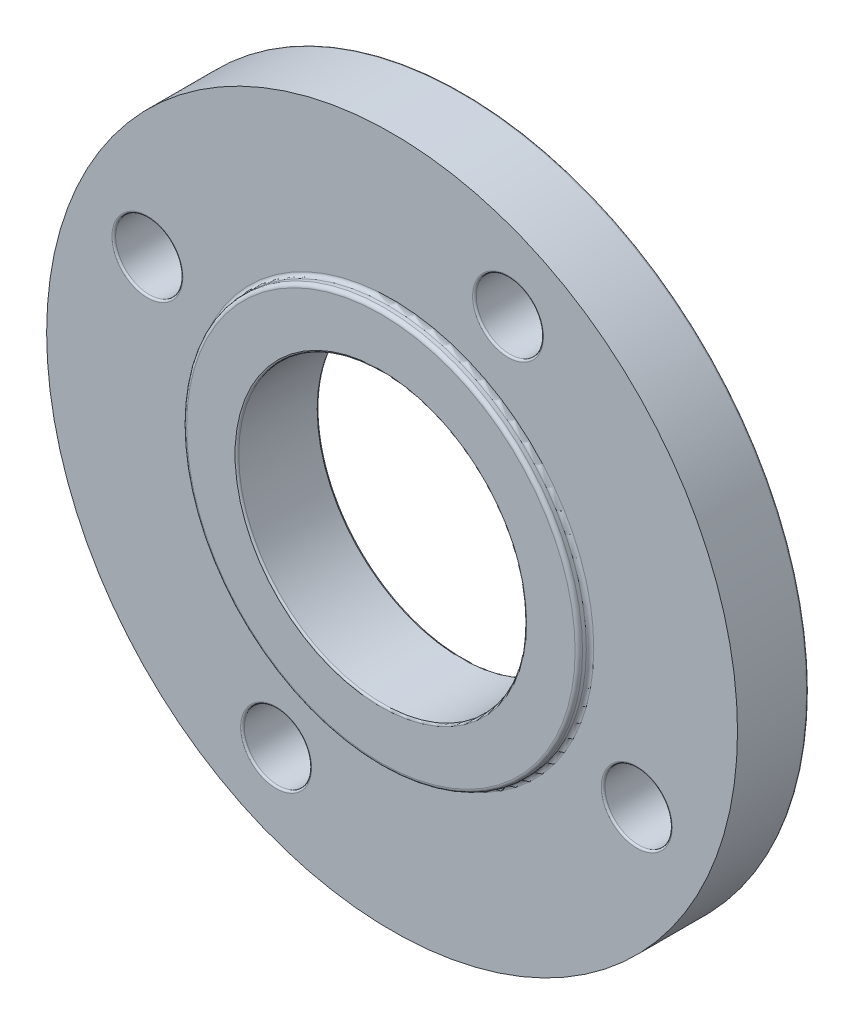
ISO-10303-21;
HEADER;
FILE_DESCRIPTION(('STEP AP214'),'2;1');
FILE_NAME('part.step','',(''),(''),'','','');
FILE_SCHEMA(('AUTOMOTIVE_DESIGN { 1 0 10303 214 1 1 1 1 }'));
ENDSEC;
DATA;
#1=APPLICATION_CONTEXT('core data for automotive mechanical design processes');
#2=APPLICATION_PROTOCOL_DEFINITION('international standard','automotive_design',2000,#1);
#3=PRODUCT_CONTEXT('',#1,'mechanical');
#4=PRODUCT('Part','Part','',(#3));
#5=PRODUCT_RELATED_PRODUCT_CATEGORY('part','',(#4));
#6=PRODUCT_DEFINITION_FORMATION('','',#4);
#7=PRODUCT_DEFINITION_CONTEXT('part definition',#1,'design');
#8=PRODUCT_DEFINITION('design','',#6,#7);
#9=PRODUCT_DEFINITION_SHAPE('','',#8);
#10=(LENGTH_UNIT() NAMED_UNIT(*) SI_UNIT(.MILLI.,.METRE.));
#11=(NAMED_UNIT(*) PLANE_ANGLE_UNIT() SI_UNIT($,.RADIAN.));
#12=(NAMED_UNIT(*) SI_UNIT($,.STERADIAN.) SOLID_ANGLE_UNIT());
#13=UNCERTAINTY_MEASURE_WITH_UNIT(LENGTH_MEASURE(1.E-05),#10,'distance_accuracy_value','');
#14=(GEOMETRIC_REPRESENTATION_CONTEXT(3) GLOBAL_UNCERTAINTY_ASSIGNED_CONTEXT((#13)) GLOBAL_UNIT_ASSIGNED_CONTEXT((#10,
#11,#12)) REPRESENTATION_CONTEXT('',''));
#15=CARTESIAN_POINT('',(0.,0.,0.));
#16=DIRECTION('',(0.,0.,1.));
#17=DIRECTION('',(1.,0.,0.));
#18=AXIS2_PLACEMENT_3D('',#15,#16,#17);
#19=CARTESIAN_POINT('',(0.,0.,22.));
#20=DIRECTION('',(0.,0.,1.));
#21=DIRECTION('',(1.,0.,0.));
#22=AXIS2_PLACEMENT_3D('',#19,#20,#21);
#23=PLANE('',#22);
#24=CARTESIAN_POINT('',(0.,0.,22.));
#25=DIRECTION('',(0.,0.,1.));
#26=DIRECTION('',(1.,0.,0.));
#27=AXIS2_PLACEMENT_3D('',#24,#25,#26);
#28=CIRCLE('',#27,52.0122693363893);
#29=CARTESIAN_POINT('',(52.0122693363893,0.,22.));
#30=VERTEX_POINT('',#29);
#31=EDGE_CURVE('E86',#30,#30,#28,.T.);
#32=ORIENTED_EDGE('',*,*,#31,.T.);
#33=EDGE_LOOP('',(#32));
#34=FACE_BOUND('',#33,.T.);
#35=CARTESIAN_POINT('',(0.,0.,22.));
#36=DIRECTION('',(0.,0.,1.));
#37=DIRECTION('',(1.,0.,0.));
#38=AXIS2_PLACEMENT_3D('',#35,#36,#37);
#39=CIRCLE('',#38,39.05);
#40=CARTESIAN_POINT('',(39.05,0.,22.));
#41=VERTEX_POINT('',#40);
#42=EDGE_CURVE('E105',#41,#41,#39,.F.);
#43=ORIENTED_EDGE('',*,*,#42,.T.);
#44=EDGE_LOOP('',(#43));
#45=FACE_BOUND('',#44,.T.);
#46=ADVANCED_FACE('F30',(#34,#45),#23,.T.);
#47=CARTESIAN_POINT('',(0.,0.,22.));
#48=DIRECTION('',(0.,0.,-1.));
#49=DIRECTION('',(-1.,0.,0.));
#50=AXIS2_PLACEMENT_3D('',#47,#48,#49);
#51=CYLINDRICAL_SURFACE('',#50,92.5);
#52=CARTESIAN_POINT('',(0.,0.,0.5));
#53=DIRECTION('',(0.,0.,1.));
#54=DIRECTION('',(1.,0.,0.));
#55=AXIS2_PLACEMENT_3D('',#52,#53,#54);
#56=CIRCLE('',#55,92.5);
#57=CARTESIAN_POINT('',(92.5,0.,0.5));
#58=VERTEX_POINT('',#57);
#59=EDGE_CURVE('E98',#58,#58,#56,.T.);
#60=ORIENTED_EDGE('',*,*,#59,.T.);
#61=EDGE_LOOP('',(#60));
#62=FACE_BOUND('',#61,.T.);
#63=CARTESIAN_POINT('',(0.,0.,19.));
#64=DIRECTION('',(0.,0.,1.));
#65=DIRECTION('',(1.,0.,0.));
#66=AXIS2_PLACEMENT_3D('',#63,#64,#65);
#67=CIRCLE('',#66,92.5);
#68=CARTESIAN_POINT('',(92.5,0.,19.));
#69=VERTEX_POINT('',#68);
#70=EDGE_CURVE('E99',#69,#69,#67,.T.);
#71=ORIENTED_EDGE('',*,*,#70,.F.);
#72=EDGE_LOOP('',(#71));
#73=FACE_BOUND('',#72,.T.);
#74=ADVANCED_FACE('F130',(#62,#73),#51,.T.);
#75=CARTESIAN_POINT('',(0.,0.,0.));
#76=DIRECTION('',(0.,0.,1.));
#77=DIRECTION('',(1.,0.,0.));
#78=AXIS2_PLACEMENT_3D('',#75,#76,#77);
#79=PLANE('',#78);
#80=CARTESIAN_POINT('',(-31.0521182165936,-65.513479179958,0.));
#81=DIRECTION('',(0.,0.,1.));
#82=DIRECTION('',(1.,0.,0.));
#83=AXIS2_PLACEMENT_3D('',#80,#81,#82);
#84=CIRCLE('',#83,9.50000000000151);
#85=CARTESIAN_POINT('',(-21.5521182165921,-65.513479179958,0.));
#86=VERTEX_POINT('',#85);
#87=EDGE_CURVE('E56',#86,#86,#84,.T.);
#88=ORIENTED_EDGE('',*,*,#87,.T.);
#89=EDGE_LOOP('',(#88));
#90=FACE_BOUND('',#89,.T.);
#91=CARTESIAN_POINT('',(65.5134791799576,-31.0521182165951,0.));
#92=DIRECTION('',(0.,0.,1.));
#93=DIRECTION('',(1.,0.,0.));
#94=AXIS2_PLACEMENT_3D('',#91,#92,#93);
#95=CIRCLE('',#94,9.50000000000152);
#96=CARTESIAN_POINT('',(75.0134791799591,-31.0521182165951,0.));
#97=VERTEX_POINT('',#96);
#98=EDGE_CURVE('E59',#97,#97,#95,.T.);
#99=ORIENTED_EDGE('',*,*,#98,.T.);
#100=EDGE_LOOP('',(#99));
#101=FACE_BOUND('',#100,.T.);
#102=CARTESIAN_POINT('',(31.0521182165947,65.513479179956,0.));
#103=DIRECTION('',(0.,0.,1.));
#104=DIRECTION('',(1.,0.,0.));
#105=AXIS2_PLACEMENT_3D('',#102,#103,#104);
#106=CIRCLE('',#105,9.50000000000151);
#107=CARTESIAN_POINT('',(40.5521182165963,65.513479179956,0.));
#108=VERTEX_POINT('',#107);
#109=EDGE_CURVE('E62',#108,#108,#106,.T.);
#110=ORIENTED_EDGE('',*,*,#109,.T.);
#111=EDGE_LOOP('',(#110));
#112=FACE_BOUND('',#111,.T.);
#113=CARTESIAN_POINT('',(-65.5134791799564,31.0521182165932,0.));
#114=DIRECTION('',(0.,0.,1.));
#115=DIRECTION('',(1.,0.,0.));
#116=AXIS2_PLACEMENT_3D('',#113,#114,#115);
#117=CIRCLE('',#116,9.50000000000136);
#118=CARTESIAN_POINT('',(-56.0134791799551,31.0521182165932,0.));
#119=VERTEX_POINT('',#118);
#120=EDGE_CURVE('E65',#119,#119,#117,.T.);
#121=ORIENTED_EDGE('',*,*,#120,.T.);
#122=EDGE_LOOP('',(#121));
#123=FACE_BOUND('',#122,.T.);
#124=CARTESIAN_POINT('',(0.,0.,0.));
#125=DIRECTION('',(0.,0.,1.));
#126=DIRECTION('',(1.,0.,0.));
#127=AXIS2_PLACEMENT_3D('',#124,#125,#126);
#128=CIRCLE('',#127,39.05);
#129=CARTESIAN_POINT('',(39.05,0.,0.));
#130=VERTEX_POINT('',#129);
#131=EDGE_CURVE('E114',#130,#130,#128,.T.);
#132=ORIENTED_EDGE('',*,*,#131,.T.);
#133=EDGE_LOOP('',(#132));
#134=FACE_BOUND('',#133,.T.);
#135=CARTESIAN_POINT('',(0.,0.,0.));
#136=DIRECTION('',(0.,0.,1.));
#137=DIRECTION('',(1.,0.,0.));
#138=AXIS2_PLACEMENT_3D('',#135,#136,#137);
#139=CIRCLE('',#138,92.);
#140=CARTESIAN_POINT('',(92.,0.,0.));
#141=VERTEX_POINT('',#140);
#142=EDGE_CURVE('E102',#141,#141,#139,.F.);
#143=ORIENTED_EDGE('',*,*,#142,.T.);
#144=EDGE_LOOP('',(#143));
#145=FACE_BOUND('',#144,.T.);
#146=ADVANCED_FACE('F120',(#90,#101,#112,#123,#134,#145),#79,.F.);
#147=CARTESIAN_POINT('',(0.,0.,22.));
#148=DIRECTION('',(0.,0.,-1.));
#149=DIRECTION('',(-1.,0.,0.));
#150=AXIS2_PLACEMENT_3D('',#147,#148,#149);
#151=CYLINDRICAL_SURFACE('',#150,38.55);
#152=CARTESIAN_POINT('',(0.,0.,0.5));
#153=DIRECTION('',(0.,0.,1.));
#154=DIRECTION('',(1.,0.,0.));
#155=AXIS2_PLACEMENT_3D('',#152,#153,#154);
#156=CIRCLE('',#155,38.55);
#157=CARTESIAN_POINT('',(38.55,0.,0.5));
#158=VERTEX_POINT('',#157);
#159=EDGE_CURVE('E108',#158,#158,#156,.F.);
#160=ORIENTED_EDGE('',*,*,#159,.T.);
#161=EDGE_LOOP('',(#160));
#162=FACE_BOUND('',#161,.T.);
#163=CARTESIAN_POINT('',(0.,0.,21.5));
#164=DIRECTION('',(0.,0.,1.));
#165=DIRECTION('',(1.,0.,0.));
#166=AXIS2_PLACEMENT_3D('',#163,#164,#165);
#167=CIRCLE('',#166,38.55);
#168=CARTESIAN_POINT('',(38.55,0.,21.5));
#169=VERTEX_POINT('',#168);
#170=EDGE_CURVE('E111',#169,#169,#167,.T.);
#171=ORIENTED_EDGE('',*,*,#170,.T.);
#172=EDGE_LOOP('',(#171));
#173=FACE_BOUND('',#172,.T.);
#174=ADVANCED_FACE('F155',(#162,#173),#151,.F.);
#175=CARTESIAN_POINT('',(0.,0.,0.5));
#176=DIRECTION('',(0.,0.,1.));
#177=DIRECTION('',(1.,0.,0.));
#178=AXIS2_PLACEMENT_3D('',#175,#176,#177);
#179=TOROIDAL_SURFACE('',#178,39.05,0.5);
#180=ORIENTED_EDGE('',*,*,#159,.F.);
#181=EDGE_LOOP('',(#180));
#182=FACE_BOUND('',#181,.T.);
#183=ORIENTED_EDGE('',*,*,#131,.F.);
#184=EDGE_LOOP('',(#183));
#185=FACE_BOUND('',#184,.T.);
#186=ADVANCED_FACE('F159',(#182,#185),#179,.T.);
#187=CARTESIAN_POINT('',(0.,0.,21.5));
#188=DIRECTION('',(0.,0.,1.));
#189=DIRECTION('',(1.,0.,0.));
#190=AXIS2_PLACEMENT_3D('',#187,#188,#189);
#191=TOROIDAL_SURFACE('',#190,39.05,0.5);
#192=ORIENTED_EDGE('',*,*,#42,.F.);
#193=EDGE_LOOP('',(#192));
#194=FACE_BOUND('',#193,.T.);
#195=ORIENTED_EDGE('',*,*,#170,.F.);
#196=EDGE_LOOP('',(#195));
#197=FACE_BOUND('',#196,.T.);
#198=ADVANCED_FACE('F126',(#194,#197),#191,.T.);
#199=CARTESIAN_POINT('',(0.,0.,0.5));
#200=DIRECTION('',(0.,0.,1.));
#201=DIRECTION('',(1.,0.,0.));
#202=AXIS2_PLACEMENT_3D('',#199,#200,#201);
#203=TOROIDAL_SURFACE('',#202,92.,0.5);
#204=ORIENTED_EDGE('',*,*,#142,.F.);
#205=EDGE_LOOP('',(#204));
#206=FACE_BOUND('',#205,.T.);
#207=ORIENTED_EDGE('',*,*,#59,.F.);
#208=EDGE_LOOP('',(#207));
#209=FACE_BOUND('',#208,.T.);
#210=ADVANCED_FACE('F122',(#206,#209),#203,.T.);
#211=CARTESIAN_POINT('',(0.,0.,19.));
#212=DIRECTION('',(0.,0.,1.));
#213=DIRECTION('',(1.,0.,0.));
#214=AXIS2_PLACEMENT_3D('',#211,#212,#213);
#215=PLANE('',#214);
#216=CARTESIAN_POINT('',(-31.0521182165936,-65.513479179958,19.));
#217=DIRECTION('',(0.,0.,1.));
#218=DIRECTION('',(1.,0.,0.));
#219=AXIS2_PLACEMENT_3D('',#216,#217,#218);
#220=CIRCLE('',#219,9.50000000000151);
#221=CARTESIAN_POINT('',(-21.5521182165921,-65.513479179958,19.));
#222=VERTEX_POINT('',#221);
#223=EDGE_CURVE('E68',#222,#222,#220,.F.);
#224=ORIENTED_EDGE('',*,*,#223,.T.);
#225=EDGE_LOOP('',(#224));
#226=FACE_BOUND('',#225,.T.);
#227=CARTESIAN_POINT('',(65.5134791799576,-31.0521182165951,19.));
#228=DIRECTION('',(0.,0.,1.));
#229=DIRECTION('',(1.,0.,0.));
#230=AXIS2_PLACEMENT_3D('',#227,#228,#229);
#231=CIRCLE('',#230,9.50000000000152);
#232=CARTESIAN_POINT('',(75.0134791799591,-31.0521182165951,19.));
#233=VERTEX_POINT('',#232);
#234=EDGE_CURVE('E71',#233,#233,#231,.F.);
#235=ORIENTED_EDGE('',*,*,#234,.T.);
#236=EDGE_LOOP('',(#235));
#237=FACE_BOUND('',#236,.T.);
#238=CARTESIAN_POINT('',(31.0521182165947,65.513479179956,19.));
#239=DIRECTION('',(0.,0.,1.));
#240=DIRECTION('',(1.,0.,0.));
#241=AXIS2_PLACEMENT_3D('',#238,#239,#240);
#242=CIRCLE('',#241,9.50000000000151);
#243=CARTESIAN_POINT('',(40.5521182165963,65.513479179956,19.));
#244=VERTEX_POINT('',#243);
#245=EDGE_CURVE('E74',#244,#244,#242,.F.);
#246=ORIENTED_EDGE('',*,*,#245,.T.);
#247=EDGE_LOOP('',(#246));
#248=FACE_BOUND('',#247,.T.);
#249=CARTESIAN_POINT('',(-65.5134791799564,31.0521182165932,19.));
#250=DIRECTION('',(0.,0.,1.));
#251=DIRECTION('',(1.,0.,0.));
#252=AXIS2_PLACEMENT_3D('',#249,#250,#251);
#253=CIRCLE('',#252,9.50000000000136);
#254=CARTESIAN_POINT('',(-56.0134791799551,31.0521182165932,19.));
#255=VERTEX_POINT('',#254);
#256=EDGE_CURVE('E77',#255,#255,#253,.F.);
#257=ORIENTED_EDGE('',*,*,#256,.T.);
#258=EDGE_LOOP('',(#257));
#259=FACE_BOUND('',#258,.T.);
#260=CARTESIAN_POINT('',(0.,0.,19.));
#261=DIRECTION('',(0.,0.,1.));
#262=DIRECTION('',(1.,0.,0.));
#263=AXIS2_PLACEMENT_3D('',#260,#261,#262);
#264=CIRCLE('',#263,54.0122693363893);
#265=CARTESIAN_POINT('',(54.0122693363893,0.,19.));
#266=VERTEX_POINT('',#265);
#267=EDGE_CURVE('E89',#266,#266,#264,.F.);
#268=ORIENTED_EDGE('',*,*,#267,.T.);
#269=EDGE_LOOP('',(#268));
#270=FACE_BOUND('',#269,.T.);
#271=ORIENTED_EDGE('',*,*,#70,.T.);
#272=EDGE_LOOP('',(#271));
#273=FACE_BOUND('',#272,.T.);
#274=ADVANCED_FACE('F125',(#226,#237,#248,#259,#270,#273),#215,.T.);
#275=CARTESIAN_POINT('',(0.,0.,19.));
#276=DIRECTION('',(0.,0.,1.));
#277=DIRECTION('',(1.,0.,0.));
#278=AXIS2_PLACEMENT_3D('',#275,#276,#277);
#279=CYLINDRICAL_SURFACE('',#278,53.0122693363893);
#280=CARTESIAN_POINT('',(0.,0.,20.));
#281=DIRECTION('',(0.,0.,1.));
#282=DIRECTION('',(1.,0.,0.));
#283=AXIS2_PLACEMENT_3D('',#280,#281,#282);
#284=CIRCLE('',#283,53.0122693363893);
#285=CARTESIAN_POINT('',(53.0122693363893,0.,20.));
#286=VERTEX_POINT('',#285);
#287=EDGE_CURVE('E92',#286,#286,#284,.T.);
#288=ORIENTED_EDGE('',*,*,#287,.T.);
#289=EDGE_LOOP('',(#288));
#290=FACE_BOUND('',#289,.T.);
#291=CARTESIAN_POINT('',(0.,0.,21.));
#292=DIRECTION('',(0.,0.,1.));
#293=DIRECTION('',(1.,0.,0.));
#294=AXIS2_PLACEMENT_3D('',#291,#292,#293);
#295=CIRCLE('',#294,53.0122693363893);
#296=CARTESIAN_POINT('',(53.0122693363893,0.,21.));
#297=VERTEX_POINT('',#296);
#298=EDGE_CURVE('E95',#297,#297,#295,.F.);
#299=ORIENTED_EDGE('',*,*,#298,.T.);
#300=EDGE_LOOP('',(#299));
#301=FACE_BOUND('',#300,.T.);
#302=ADVANCED_FACE('F137',(#290,#301),#279,.T.);
#303=CARTESIAN_POINT('',(0.,0.,20.));
#304=DIRECTION('',(0.,0.,1.));
#305=DIRECTION('',(1.,0.,0.));
#306=AXIS2_PLACEMENT_3D('',#303,#304,#305);
#307=TOROIDAL_SURFACE('',#306,54.0122693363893,1.);
#308=ORIENTED_EDGE('',*,*,#267,.F.);
#309=EDGE_LOOP('',(#308));
#310=FACE_BOUND('',#309,.T.);
#311=ORIENTED_EDGE('',*,*,#287,.F.);
#312=EDGE_LOOP('',(#311));
#313=FACE_BOUND('',#312,.T.);
#314=ADVANCED_FACE('F143',(#310,#313),#307,.F.);
#315=CARTESIAN_POINT('',(0.,0.,21.));
#316=DIRECTION('',(0.,0.,1.));
#317=DIRECTION('',(1.,0.,0.));
#318=AXIS2_PLACEMENT_3D('',#315,#316,#317);
#319=TOROIDAL_SURFACE('',#318,52.0122693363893,1.);
#320=ORIENTED_EDGE('',*,*,#298,.F.);
#321=EDGE_LOOP('',(#320));
#322=FACE_BOUND('',#321,.T.);
#323=ORIENTED_EDGE('',*,*,#31,.F.);
#324=EDGE_LOOP('',(#323));
#325=FACE_BOUND('',#324,.T.);
#326=ADVANCED_FACE('F168',(#322,#325),#319,.T.);
#327=CARTESIAN_POINT('',(65.5134791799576,-31.0521182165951,0.));
#328=DIRECTION('',(0.,0.,1.));
#329=DIRECTION('',(1.,0.,0.));
#330=AXIS2_PLACEMENT_3D('',#327,#328,#329);
#331=CYLINDRICAL_SURFACE('',#330,9.00000000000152);
#332=CARTESIAN_POINT('',(65.5134791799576,-31.0521182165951,18.5));
#333=DIRECTION('',(0.,0.,1.));
#334=DIRECTION('',(1.,0.,0.));
#335=AXIS2_PLACEMENT_3D('',#332,#333,#334);
#336=CIRCLE('',#335,9.00000000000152);
#337=CARTESIAN_POINT('',(74.5134791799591,-31.0521182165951,18.5));
#338=VERTEX_POINT('',#337);
#339=EDGE_CURVE('E50',#338,#338,#336,.T.);
#340=ORIENTED_EDGE('',*,*,#339,.T.);
#341=EDGE_LOOP('',(#340));
#342=FACE_BOUND('',#341,.T.);
#343=CARTESIAN_POINT('',(65.5134791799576,-31.0521182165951,0.5));
#344=DIRECTION('',(0.,0.,1.));
#345=DIRECTION('',(1.,0.,0.));
#346=AXIS2_PLACEMENT_3D('',#343,#344,#345);
#347=CIRCLE('',#346,9.00000000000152);
#348=CARTESIAN_POINT('',(74.5134791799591,-31.0521182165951,0.5));
#349=VERTEX_POINT('',#348);
#350=EDGE_CURVE('E53',#349,#349,#347,.F.);
#351=ORIENTED_EDGE('',*,*,#350,.T.);
#352=EDGE_LOOP('',(#351));
#353=FACE_BOUND('',#352,.T.);
#354=ADVANCED_FACE('F172',(#342,#353),#331,.F.);
#355=CARTESIAN_POINT('',(-31.0521182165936,-65.513479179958,0.));
#356=DIRECTION('',(0.,0.,1.));
#357=DIRECTION('',(1.,0.,0.));
#358=AXIS2_PLACEMENT_3D('',#355,#356,#357);
#359=CYLINDRICAL_SURFACE('',#358,9.00000000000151);
#360=CARTESIAN_POINT('',(-31.0521182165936,-65.513479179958,18.5));
#361=DIRECTION('',(0.,0.,1.));
#362=DIRECTION('',(1.,0.,0.));
#363=AXIS2_PLACEMENT_3D('',#360,#361,#362);
#364=CIRCLE('',#363,9.00000000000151);
#365=CARTESIAN_POINT('',(-22.0521182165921,-65.513479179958,18.5));
#366=VERTEX_POINT('',#365);
#367=EDGE_CURVE('E80',#366,#366,#364,.T.);
#368=ORIENTED_EDGE('',*,*,#367,.T.);
#369=EDGE_LOOP('',(#368));
#370=FACE_BOUND('',#369,.T.);
#371=CARTESIAN_POINT('',(-31.0521182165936,-65.513479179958,0.5));
#372=DIRECTION('',(0.,0.,1.));
#373=DIRECTION('',(1.,0.,0.));
#374=AXIS2_PLACEMENT_3D('',#371,#372,#373);
#375=CIRCLE('',#374,9.00000000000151);
#376=CARTESIAN_POINT('',(-22.0521182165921,-65.513479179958,0.5));
#377=VERTEX_POINT('',#376);
#378=EDGE_CURVE('E83',#377,#377,#375,.F.);
#379=ORIENTED_EDGE('',*,*,#378,.T.);
#380=EDGE_LOOP('',(#379));
#381=FACE_BOUND('',#380,.T.);
#382=ADVANCED_FACE('F283',(#370,#381),#359,.F.);
#383=CARTESIAN_POINT('',(-65.5134791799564,31.0521182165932,0.));
#384=DIRECTION('',(0.,0.,1.));
#385=DIRECTION('',(1.,0.,0.));
#386=AXIS2_PLACEMENT_3D('',#383,#384,#385);
#387=CYLINDRICAL_SURFACE('',#386,9.00000000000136);
#388=CARTESIAN_POINT('',(-65.5134791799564,31.0521182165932,0.5));
#389=DIRECTION('',(0.,0.,1.));
#390=DIRECTION('',(1.,0.,0.));
#391=AXIS2_PLACEMENT_3D('',#388,#389,#390);
#392=CIRCLE('',#391,9.00000000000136);
#393=CARTESIAN_POINT('',(-56.5134791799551,31.0521182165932,0.5));
#394=VERTEX_POINT('',#393);
#395=EDGE_CURVE('E10',#394,#394,#392,.F.);
#396=ORIENTED_EDGE('',*,*,#395,.T.);
#397=EDGE_LOOP('',(#396));
#398=FACE_BOUND('',#397,.T.);
#399=CARTESIAN_POINT('',(-65.5134791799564,31.0521182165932,18.5));
#400=DIRECTION('',(0.,0.,1.));
#401=DIRECTION('',(1.,0.,0.));
#402=AXIS2_PLACEMENT_3D('',#399,#400,#401);
#403=CIRCLE('',#402,9.00000000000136);
#404=CARTESIAN_POINT('',(-56.5134791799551,31.0521182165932,18.5));
#405=VERTEX_POINT('',#404);
#406=EDGE_CURVE('E37',#405,#405,#403,.T.);
#407=ORIENTED_EDGE('',*,*,#406,.T.);
#408=EDGE_LOOP('',(#407));
#409=FACE_BOUND('',#408,.T.);
#410=ADVANCED_FACE('F273',(#398,#409),#387,.F.);
#411=CARTESIAN_POINT('',(31.0521182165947,65.513479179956,0.));
#412=DIRECTION('',(0.,0.,1.));
#413=DIRECTION('',(1.,0.,0.));
#414=AXIS2_PLACEMENT_3D('',#411,#412,#413);
#415=CYLINDRICAL_SURFACE('',#414,9.00000000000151);
#416=CARTESIAN_POINT('',(31.0521182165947,65.513479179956,0.5));
#417=DIRECTION('',(0.,0.,1.));
#418=DIRECTION('',(1.,0.,0.));
#419=AXIS2_PLACEMENT_3D('',#416,#417,#418);
#420=CIRCLE('',#419,9.00000000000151);
#421=CARTESIAN_POINT('',(40.0521182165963,65.513479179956,0.5));
#422=VERTEX_POINT('',#421);
#423=EDGE_CURVE('E41',#422,#422,#420,.F.);
#424=ORIENTED_EDGE('',*,*,#423,.T.);
#425=EDGE_LOOP('',(#424));
#426=FACE_BOUND('',#425,.T.);
#427=CARTESIAN_POINT('',(31.0521182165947,65.513479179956,18.5));
#428=DIRECTION('',(0.,0.,1.));
#429=DIRECTION('',(1.,0.,0.));
#430=AXIS2_PLACEMENT_3D('',#427,#428,#429);
#431=CIRCLE('',#430,9.00000000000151);
#432=CARTESIAN_POINT('',(40.0521182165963,65.513479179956,18.5));
#433=VERTEX_POINT('',#432);
#434=EDGE_CURVE('E45',#433,#433,#431,.T.);
#435=ORIENTED_EDGE('',*,*,#434,.T.);
#436=EDGE_LOOP('',(#435));
#437=FACE_BOUND('',#436,.T.);
#438=ADVANCED_FACE('F178',(#426,#437),#415,.F.);
#439=CARTESIAN_POINT('',(-31.0521182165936,-65.513479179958,18.5));
#440=DIRECTION('',(0.,0.,1.));
#441=DIRECTION('',(1.,0.,0.));
#442=AXIS2_PLACEMENT_3D('',#439,#440,#441);
#443=TOROIDAL_SURFACE('',#442,9.50000000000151,0.5);
#444=ORIENTED_EDGE('',*,*,#223,.F.);
#445=EDGE_LOOP('',(#444));
#446=FACE_BOUND('',#445,.T.);
#447=ORIENTED_EDGE('',*,*,#367,.F.);
#448=EDGE_LOOP('',(#447));
#449=FACE_BOUND('',#448,.T.);
#450=ADVANCED_FACE('F174',(#446,#449),#443,.T.);
#451=CARTESIAN_POINT('',(-31.0521182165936,-65.513479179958,0.5));
#452=DIRECTION('',(0.,0.,1.));
#453=DIRECTION('',(1.,0.,0.));
#454=AXIS2_PLACEMENT_3D('',#451,#452,#453);
#455=TOROIDAL_SURFACE('',#454,9.50000000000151,0.5);
#456=ORIENTED_EDGE('',*,*,#378,.F.);
#457=EDGE_LOOP('',(#456));
#458=FACE_BOUND('',#457,.T.);
#459=ORIENTED_EDGE('',*,*,#87,.F.);
#460=EDGE_LOOP('',(#459));
#461=FACE_BOUND('',#460,.T.);
#462=ADVANCED_FACE('F177',(#458,#461),#455,.T.);
#463=CARTESIAN_POINT('',(65.5134791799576,-31.0521182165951,18.5));
#464=DIRECTION('',(0.,0.,1.));
#465=DIRECTION('',(1.,0.,0.));
#466=AXIS2_PLACEMENT_3D('',#463,#464,#465);
#467=TOROIDAL_SURFACE('',#466,9.50000000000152,0.5);
#468=ORIENTED_EDGE('',*,*,#234,.F.);
#469=EDGE_LOOP('',(#468));
#470=FACE_BOUND('',#469,.T.);
#471=ORIENTED_EDGE('',*,*,#339,.F.);
#472=EDGE_LOOP('',(#471));
#473=FACE_BOUND('',#472,.T.);
#474=ADVANCED_FACE('F182',(#470,#473),#467,.T.);
#475=CARTESIAN_POINT('',(65.5134791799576,-31.0521182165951,0.5));
#476=DIRECTION('',(0.,0.,1.));
#477=DIRECTION('',(1.,0.,0.));
#478=AXIS2_PLACEMENT_3D('',#475,#476,#477);
#479=TOROIDAL_SURFACE('',#478,9.50000000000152,0.5);
#480=ORIENTED_EDGE('',*,*,#350,.F.);
#481=EDGE_LOOP('',(#480));
#482=FACE_BOUND('',#481,.T.);
#483=ORIENTED_EDGE('',*,*,#98,.F.);
#484=EDGE_LOOP('',(#483));
#485=FACE_BOUND('',#484,.T.);
#486=ADVANCED_FACE('F186',(#482,#485),#479,.T.);
#487=CARTESIAN_POINT('',(31.0521182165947,65.513479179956,0.5));
#488=DIRECTION('',(0.,0.,1.));
#489=DIRECTION('',(1.,0.,0.));
#490=AXIS2_PLACEMENT_3D('',#487,#488,#489);
#491=TOROIDAL_SURFACE('',#490,9.50000000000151,0.5);
#492=ORIENTED_EDGE('',*,*,#423,.F.);
#493=EDGE_LOOP('',(#492));
#494=FACE_BOUND('',#493,.T.);
#495=ORIENTED_EDGE('',*,*,#109,.F.);
#496=EDGE_LOOP('',(#495));
#497=FACE_BOUND('',#496,.T.);
#498=ADVANCED_FACE('F190',(#494,#497),#491,.T.);
#499=CARTESIAN_POINT('',(31.0521182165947,65.513479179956,18.5));
#500=DIRECTION('',(0.,0.,1.));
#501=DIRECTION('',(1.,0.,0.));
#502=AXIS2_PLACEMENT_3D('',#499,#500,#501);
#503=TOROIDAL_SURFACE('',#502,9.50000000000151,0.5);
#504=ORIENTED_EDGE('',*,*,#245,.F.);
#505=EDGE_LOOP('',(#504));
#506=FACE_BOUND('',#505,.T.);
#507=ORIENTED_EDGE('',*,*,#434,.F.);
#508=EDGE_LOOP('',(#507));
#509=FACE_BOUND('',#508,.T.);
#510=ADVANCED_FACE('F194',(#506,#509),#503,.T.);
#511=CARTESIAN_POINT('',(-65.5134791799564,31.0521182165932,0.5));
#512=DIRECTION('',(0.,0.,1.));
#513=DIRECTION('',(1.,0.,0.));
#514=AXIS2_PLACEMENT_3D('',#511,#512,#513);
#515=TOROIDAL_SURFACE('',#514,9.50000000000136,0.5);
#516=ORIENTED_EDGE('',*,*,#395,.F.);
#517=EDGE_LOOP('',(#516));
#518=FACE_BOUND('',#517,.T.);
#519=ORIENTED_EDGE('',*,*,#120,.F.);
#520=EDGE_LOOP('',(#519));
#521=FACE_BOUND('',#520,.T.);
#522=ADVANCED_FACE('F197',(#518,#521),#515,.T.);
#523=CARTESIAN_POINT('',(-65.5134791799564,31.0521182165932,18.5));
#524=DIRECTION('',(0.,0.,1.));
#525=DIRECTION('',(1.,0.,0.));
#526=AXIS2_PLACEMENT_3D('',#523,#524,#525);
#527=TOROIDAL_SURFACE('',#526,9.50000000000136,0.5);
#528=ORIENTED_EDGE('',*,*,#256,.F.);
#529=EDGE_LOOP('',(#528));
#530=FACE_BOUND('',#529,.T.);
#531=ORIENTED_EDGE('',*,*,#406,.F.);
#532=EDGE_LOOP('',(#531));
#533=FACE_BOUND('',#532,.T.);
#534=ADVANCED_FACE('F32',(#530,#533),#527,.T.);
#535=CLOSED_SHELL('',(#46,#74,#146,#174,#186,#198,#210,#274,#302,#314,#326,#354,#382,#410,#438,
#450,#462,#474,#486,#498,#510,#522,#534));
#536=MANIFOLD_SOLID_BREP('B2',#535);
#537=ADVANCED_BREP_SHAPE_REPRESENTATION('',(#18,#536),#14);
#538=SHAPE_DEFINITION_REPRESENTATION(#9,#537);
ENDSEC;
END-ISO-10303-21;
